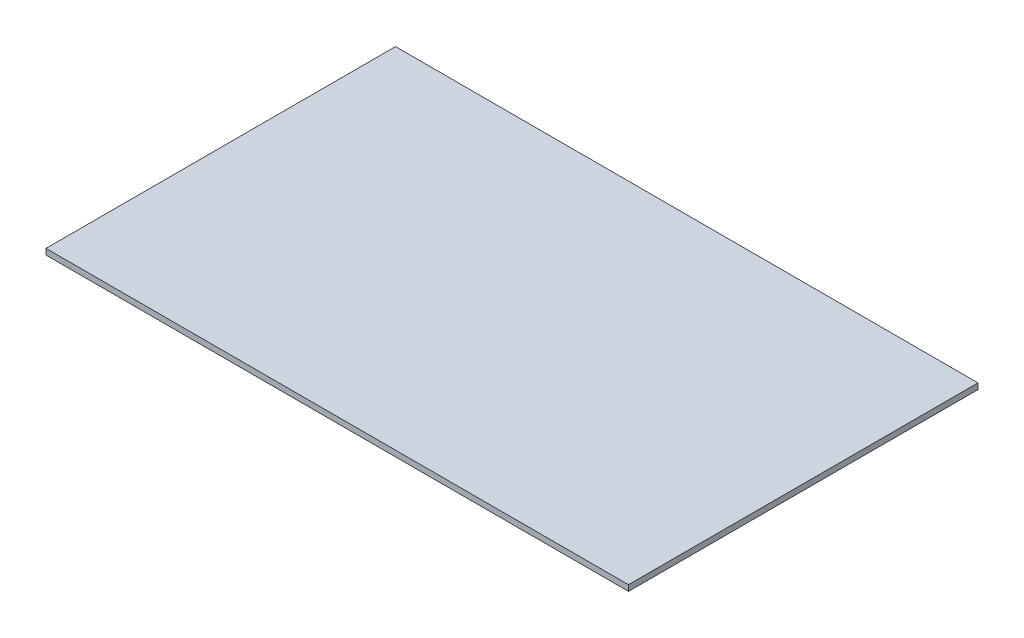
ISO-10303-21;
HEADER;
FILE_DESCRIPTION(('STEP AP214'),'2;1');
FILE_NAME('part.step','',(''),(''),'','','');
FILE_SCHEMA(('AUTOMOTIVE_DESIGN { 1 0 10303 214 1 1 1 1 }'));
ENDSEC;
DATA;
#1=APPLICATION_CONTEXT('core data for automotive mechanical design processes');
#2=APPLICATION_PROTOCOL_DEFINITION('international standard','automotive_design',2000,#1);
#3=PRODUCT_CONTEXT('',#1,'mechanical');
#4=PRODUCT('Part','Part','',(#3));
#5=PRODUCT_RELATED_PRODUCT_CATEGORY('part','',(#4));
#6=PRODUCT_DEFINITION_FORMATION('','',#4);
#7=PRODUCT_DEFINITION_CONTEXT('part definition',#1,'design');
#8=PRODUCT_DEFINITION('design','',#6,#7);
#9=PRODUCT_DEFINITION_SHAPE('','',#8);
#10=(LENGTH_UNIT() NAMED_UNIT(*) SI_UNIT(.MILLI.,.METRE.));
#11=(NAMED_UNIT(*) PLANE_ANGLE_UNIT() SI_UNIT($,.RADIAN.));
#12=(NAMED_UNIT(*) SI_UNIT($,.STERADIAN.) SOLID_ANGLE_UNIT());
#13=UNCERTAINTY_MEASURE_WITH_UNIT(LENGTH_MEASURE(1.E-05),#10,'distance_accuracy_value','');
#14=(GEOMETRIC_REPRESENTATION_CONTEXT(3) GLOBAL_UNCERTAINTY_ASSIGNED_CONTEXT((#13)) GLOBAL_UNIT_ASSIGNED_CONTEXT((#10,
#11,#12)) REPRESENTATION_CONTEXT('',''));
#15=CARTESIAN_POINT('',(0.,0.,0.));
#16=DIRECTION('',(0.,0.,1.));
#17=DIRECTION('',(1.,0.,0.));
#18=AXIS2_PLACEMENT_3D('',#15,#16,#17);
#19=CARTESIAN_POINT('',(0.,0.,300.));
#20=DIRECTION('',(1.,0.,0.));
#21=DIRECTION('',(0.,0.,-1.));
#22=AXIS2_PLACEMENT_3D('',#19,#20,#21);
#23=PLANE('',#22);
#24=DIRECTION('',(0.,-1.,0.));
#25=VECTOR('',#24,1.);
#26=CARTESIAN_POINT('',(0.,0.,0.));
#27=LINE('',#26,#25);
#28=CARTESIAN_POINT('',(0.,5.,0.));
#29=VERTEX_POINT('',#28);
#30=CARTESIAN_POINT('',(0.,0.,0.));
#31=VERTEX_POINT('',#30);
#32=EDGE_CURVE('E94',#29,#31,#27,.T.);
#33=ORIENTED_EDGE('',*,*,#32,.T.);
#34=DIRECTION('',(0.,0.,-1.));
#35=VECTOR('',#34,1.);
#36=CARTESIAN_POINT('',(0.,0.,300.));
#37=LINE('',#36,#35);
#38=CARTESIAN_POINT('',(0.,0.,300.));
#39=VERTEX_POINT('',#38);
#40=EDGE_CURVE('E11',#39,#31,#37,.T.);
#41=ORIENTED_EDGE('',*,*,#40,.F.);
#42=DIRECTION('',(0.,-1.,0.));
#43=VECTOR('',#42,1.);
#44=CARTESIAN_POINT('',(0.,0.,300.));
#45=LINE('',#44,#43);
#46=CARTESIAN_POINT('',(0.,5.,300.));
#47=VERTEX_POINT('',#46);
#48=EDGE_CURVE('E82',#47,#39,#45,.T.);
#49=ORIENTED_EDGE('',*,*,#48,.F.);
#50=DIRECTION('',(0.,0.,-1.));
#51=VECTOR('',#50,1.);
#52=CARTESIAN_POINT('',(0.,5.,300.));
#53=LINE('',#52,#51);
#54=EDGE_CURVE('E90',#47,#29,#53,.T.);
#55=ORIENTED_EDGE('',*,*,#54,.T.);
#56=EDGE_LOOP('',(#33,#41,#49,#55));
#57=FACE_BOUND('',#56,.T.);
#58=ADVANCED_FACE('F31',(#57),#23,.F.);
#59=CARTESIAN_POINT('',(0.,0.,300.));
#60=DIRECTION('',(0.,1.,0.));
#61=DIRECTION('',(0.,0.,1.));
#62=AXIS2_PLACEMENT_3D('',#59,#60,#61);
#63=PLANE('',#62);
#64=DIRECTION('',(1.,0.,0.));
#65=VECTOR('',#64,1.);
#66=CARTESIAN_POINT('',(0.,0.,0.));
#67=LINE('',#66,#65);
#68=CARTESIAN_POINT('',(500.,0.,0.));
#69=VERTEX_POINT('',#68);
#70=EDGE_CURVE('E86',#31,#69,#67,.T.);
#71=ORIENTED_EDGE('',*,*,#70,.T.);
#72=DIRECTION('',(0.,0.,-1.));
#73=VECTOR('',#72,1.);
#74=CARTESIAN_POINT('',(500.,0.,300.));
#75=LINE('',#74,#73);
#76=CARTESIAN_POINT('',(500.,0.,300.));
#77=VERTEX_POINT('',#76);
#78=EDGE_CURVE('E39',#77,#69,#75,.T.);
#79=ORIENTED_EDGE('',*,*,#78,.F.);
#80=DIRECTION('',(1.,0.,0.));
#81=VECTOR('',#80,1.);
#82=CARTESIAN_POINT('',(0.,0.,300.));
#83=LINE('',#82,#81);
#84=EDGE_CURVE('E77',#39,#77,#83,.T.);
#85=ORIENTED_EDGE('',*,*,#84,.F.);
#86=ORIENTED_EDGE('',*,*,#40,.T.);
#87=EDGE_LOOP('',(#71,#79,#85,#86));
#88=FACE_BOUND('',#87,.T.);
#89=ADVANCED_FACE('F85',(#88),#63,.F.);
#90=CARTESIAN_POINT('',(500.,0.,300.));
#91=DIRECTION('',(-1.,0.,0.));
#92=DIRECTION('',(0.,0.,1.));
#93=AXIS2_PLACEMENT_3D('',#90,#91,#92);
#94=PLANE('',#93);
#95=DIRECTION('',(0.,1.,0.));
#96=VECTOR('',#95,1.);
#97=CARTESIAN_POINT('',(500.,0.,0.));
#98=LINE('',#97,#96);
#99=CARTESIAN_POINT('',(500.,5.,0.));
#100=VERTEX_POINT('',#99);
#101=EDGE_CURVE('E64',#69,#100,#98,.T.);
#102=ORIENTED_EDGE('',*,*,#101,.T.);
#103=DIRECTION('',(0.,0.,-1.));
#104=VECTOR('',#103,1.);
#105=CARTESIAN_POINT('',(500.,5.,300.));
#106=LINE('',#105,#104);
#107=CARTESIAN_POINT('',(500.,5.,300.));
#108=VERTEX_POINT('',#107);
#109=EDGE_CURVE('E87',#108,#100,#106,.T.);
#110=ORIENTED_EDGE('',*,*,#109,.F.);
#111=DIRECTION('',(0.,1.,0.));
#112=VECTOR('',#111,1.);
#113=CARTESIAN_POINT('',(500.,0.,300.));
#114=LINE('',#113,#112);
#115=EDGE_CURVE('E80',#77,#108,#114,.T.);
#116=ORIENTED_EDGE('',*,*,#115,.F.);
#117=ORIENTED_EDGE('',*,*,#78,.T.);
#118=EDGE_LOOP('',(#102,#110,#116,#117));
#119=FACE_BOUND('',#118,.T.);
#120=ADVANCED_FACE('F88',(#119),#94,.F.);
#121=CARTESIAN_POINT('',(0.,5.,300.));
#122=DIRECTION('',(0.,-1.,0.));
#123=DIRECTION('',(0.,0.,-1.));
#124=AXIS2_PLACEMENT_3D('',#121,#122,#123);
#125=PLANE('',#124);
#126=DIRECTION('',(-1.,0.,0.));
#127=VECTOR('',#126,1.);
#128=CARTESIAN_POINT('',(0.,5.,0.));
#129=LINE('',#128,#127);
#130=EDGE_CURVE('E70',#100,#29,#129,.T.);
#131=ORIENTED_EDGE('',*,*,#130,.T.);
#132=ORIENTED_EDGE('',*,*,#54,.F.);
#133=DIRECTION('',(-1.,0.,0.));
#134=VECTOR('',#133,1.);
#135=CARTESIAN_POINT('',(0.,5.,300.));
#136=LINE('',#135,#134);
#137=EDGE_CURVE('E47',#108,#47,#136,.T.);
#138=ORIENTED_EDGE('',*,*,#137,.F.);
#139=ORIENTED_EDGE('',*,*,#109,.T.);
#140=EDGE_LOOP('',(#131,#132,#138,#139));
#141=FACE_BOUND('',#140,.T.);
#142=ADVANCED_FACE('F101',(#141),#125,.F.);
#143=CARTESIAN_POINT('',(0.,5.,300.));
#144=DIRECTION('',(0.,0.,-1.));
#145=DIRECTION('',(-1.,0.,0.));
#146=AXIS2_PLACEMENT_3D('',#143,#144,#145);
#147=PLANE('',#146);
#148=ORIENTED_EDGE('',*,*,#48,.T.);
#149=ORIENTED_EDGE('',*,*,#84,.T.);
#150=ORIENTED_EDGE('',*,*,#115,.T.);
#151=ORIENTED_EDGE('',*,*,#137,.T.);
#152=EDGE_LOOP('',(#148,#149,#150,#151));
#153=FACE_BOUND('',#152,.T.);
#154=ADVANCED_FACE('F78',(#153),#147,.F.);
#155=CARTESIAN_POINT('',(0.,5.,0.));
#156=DIRECTION('',(0.,0.,-1.));
#157=DIRECTION('',(-1.,0.,0.));
#158=AXIS2_PLACEMENT_3D('',#155,#156,#157);
#159=PLANE('',#158);
#160=ORIENTED_EDGE('',*,*,#32,.F.);
#161=ORIENTED_EDGE('',*,*,#130,.F.);
#162=ORIENTED_EDGE('',*,*,#101,.F.);
#163=ORIENTED_EDGE('',*,*,#70,.F.);
#164=EDGE_LOOP('',(#160,#161,#162,#163));
#165=FACE_BOUND('',#164,.T.);
#166=ADVANCED_FACE('F104',(#165),#159,.T.);
#167=CLOSED_SHELL('',(#58,#89,#120,#142,#154,#166));
#168=MANIFOLD_SOLID_BREP('B2',#167);
#169=ADVANCED_BREP_SHAPE_REPRESENTATION('',(#18,#168),#14);
#170=SHAPE_DEFINITION_REPRESENTATION(#9,#169);
ENDSEC;
END-ISO-10303-21;
